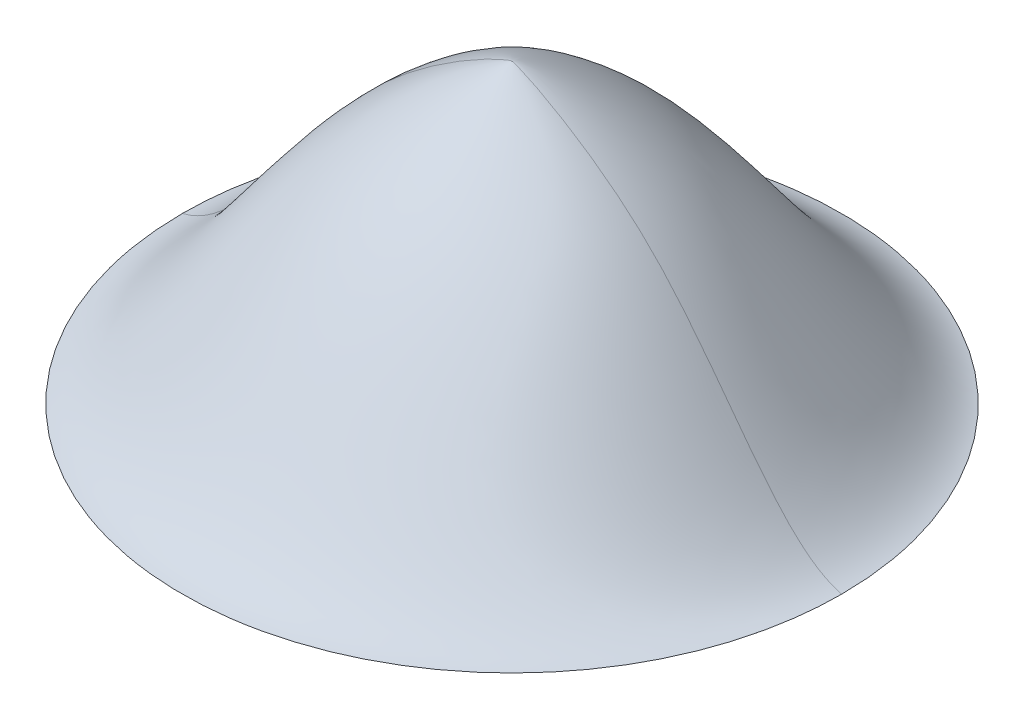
ISO-10303-21;
HEADER;
FILE_DESCRIPTION(('STEP AP214'),'2;1');
FILE_NAME('part.step','',(''),(''),'','','');
FILE_SCHEMA(('AUTOMOTIVE_DESIGN { 1 0 10303 214 1 1 1 1 }'));
ENDSEC;
DATA;
#1=APPLICATION_CONTEXT('core data for automotive mechanical design processes');
#2=APPLICATION_PROTOCOL_DEFINITION('international standard','automotive_design',2000,#1);
#3=PRODUCT_CONTEXT('',#1,'mechanical');
#4=PRODUCT('Part','Part','',(#3));
#5=PRODUCT_RELATED_PRODUCT_CATEGORY('part','',(#4));
#6=PRODUCT_DEFINITION_FORMATION('','',#4);
#7=PRODUCT_DEFINITION_CONTEXT('part definition',#1,'design');
#8=PRODUCT_DEFINITION('design','',#6,#7);
#9=PRODUCT_DEFINITION_SHAPE('','',#8);
#10=(LENGTH_UNIT() NAMED_UNIT(*) SI_UNIT(.MILLI.,.METRE.));
#11=(NAMED_UNIT(*) PLANE_ANGLE_UNIT() SI_UNIT($,.RADIAN.));
#12=(NAMED_UNIT(*) SI_UNIT($,.STERADIAN.) SOLID_ANGLE_UNIT());
#13=UNCERTAINTY_MEASURE_WITH_UNIT(LENGTH_MEASURE(1.E-05),#10,'distance_accuracy_value','');
#14=(GEOMETRIC_REPRESENTATION_CONTEXT(3) GLOBAL_UNCERTAINTY_ASSIGNED_CONTEXT((#13)) GLOBAL_UNIT_ASSIGNED_CONTEXT((#10,
#11,#12)) REPRESENTATION_CONTEXT('',''));
#15=CARTESIAN_POINT('',(0.,0.,0.));
#16=DIRECTION('',(0.,0.,1.));
#17=DIRECTION('',(1.,0.,0.));
#18=AXIS2_PLACEMENT_3D('',#15,#16,#17);
#19=CARTESIAN_POINT('',(-0.5,0.,0.));
#20=CARTESIAN_POINT('',(-0.5,0.,1.));
#21=CARTESIAN_POINT('',(0.5,0.,1.));
#22=CARTESIAN_POINT('',(0.5,0.,0.));
#23=CARTESIAN_POINT('',(-0.402796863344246,0.023485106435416,0.));
#24=CARTESIAN_POINT('',(-0.402796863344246,0.023485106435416,0.805593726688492));
#25=CARTESIAN_POINT('',(0.402796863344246,0.0234851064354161,0.805593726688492));
#26=CARTESIAN_POINT('',(0.402796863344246,0.0234851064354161,0.));
#27=CARTESIAN_POINT('',(-0.265412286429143,0.327841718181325,0.));
#28=CARTESIAN_POINT('',(-0.265412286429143,0.327841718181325,0.530824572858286));
#29=CARTESIAN_POINT('',(0.265412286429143,0.327841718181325,0.530824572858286));
#30=CARTESIAN_POINT('',(0.265412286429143,0.327841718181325,0.));
#31=CARTESIAN_POINT('',(-0.0105448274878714,0.45,0.));
#32=CARTESIAN_POINT('',(-0.0105448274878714,0.45,0.0210896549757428));
#33=CARTESIAN_POINT('',(0.0105448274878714,0.45,0.0210896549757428));
#34=CARTESIAN_POINT('',(0.0105448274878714,0.45,0.));
#35=CARTESIAN_POINT('',(0.,0.45,0.));
#36=CARTESIAN_POINT('',(0.,0.45,0.));
#37=CARTESIAN_POINT('',(0.,0.45,0.));
#38=CARTESIAN_POINT('',(0.,0.45,0.));
#39=(BOUNDED_SURFACE() B_SPLINE_SURFACE(3,3,((#19,#20,#21,#22),(#23,#24,#25,#26),(#27,#28,#29,
#30),(#31,#32,#33,#34),(#35,#36,#37,#38)),.UNSPECIFIED.,.F.,.F.,
.F.) B_SPLINE_SURFACE_WITH_KNOTS((4,1,4),(4,4),(0.,0.589485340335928,1.),(0.,1.),
.UNSPECIFIED.) GEOMETRIC_REPRESENTATION_ITEM() RATIONAL_B_SPLINE_SURFACE(((1.,0.333333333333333,
0.333333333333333,1.),(1.,0.333333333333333,0.333333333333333,1.),(1.,0.333333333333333,
0.333333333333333,1.),(1.,0.333333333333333,0.333333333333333,1.),(1.,0.333333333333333,
0.333333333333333,1.))) REPRESENTATION_ITEM('') SURFACE());
#40=CARTESIAN_POINT('',(-0.5,0.,0.));
#41=CARTESIAN_POINT('',(-0.500022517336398,0.,0.0276789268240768));
#42=CARTESIAN_POINT('',(-0.497702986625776,0.,0.0553514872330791));
#43=CARTESIAN_POINT('',(-0.488541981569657,0.,0.109938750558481));
#44=CARTESIAN_POINT('',(-0.48170050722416,0.,0.136853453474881));
#45=CARTESIAN_POINT('',(-0.463657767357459,0.,0.189179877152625));
#46=CARTESIAN_POINT('',(-0.452456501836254,0.,0.214591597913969));
#47=CARTESIAN_POINT('',(-0.425817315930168,0.,0.263566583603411));
#48=CARTESIAN_POINT('',(-0.410320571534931,0.,0.287097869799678));
#49=CARTESIAN_POINT('',(-0.375599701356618,0.,0.331229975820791));
#50=CARTESIAN_POINT('',(-0.356375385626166,0.,0.351830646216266));
#51=CARTESIAN_POINT('',(-0.315017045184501,0.,0.389271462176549));
#52=CARTESIAN_POINT('',(-0.292924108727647,0.,0.406157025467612));
#53=CARTESIAN_POINT('',(-0.246247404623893,0.,0.436038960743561));
#54=CARTESIAN_POINT('',(-0.221663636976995,0.,0.44903533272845));
#55=CARTESIAN_POINT('',(-0.170313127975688,0.,0.470939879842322));
#56=CARTESIAN_POINT('',(-0.143519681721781,0.,0.479785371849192));
#57=CARTESIAN_POINT('',(-0.0888215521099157,0.,0.492848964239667));
#58=CARTESIAN_POINT('',(-0.0609171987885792,0.,0.497068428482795));
#59=CARTESIAN_POINT('',(-0.0190542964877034,0.,0.499829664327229));
#60=CARTESIAN_POINT('',(-0.00519296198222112,0.,0.500164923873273));
#61=CARTESIAN_POINT('',(0.022509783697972,0.,0.499685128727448));
#62=CARTESIAN_POINT('',(0.0363511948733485,0.,0.498870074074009));
#63=CARTESIAN_POINT('',(0.0780933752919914,0.,0.494660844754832));
#64=CARTESIAN_POINT('',(0.105834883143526,0.,0.48947762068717));
#65=CARTESIAN_POINT('',(0.160047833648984,0.,0.474527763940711));
#66=CARTESIAN_POINT('',(0.186518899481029,0.,0.46475978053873));
#67=CARTESIAN_POINT('',(0.23708009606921,0.,0.441090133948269));
#68=CARTESIAN_POINT('',(0.261199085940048,0.,0.427250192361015));
#69=CARTESIAN_POINT('',(0.3068130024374,0.,0.395770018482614));
#70=CARTESIAN_POINT('',(0.328307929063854,0.,0.378129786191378));
#71=CARTESIAN_POINT('',(0.368371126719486,0.,0.339253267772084));
#72=CARTESIAN_POINT('',(0.386892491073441,0.,0.317968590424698));
#73=CARTESIAN_POINT('',(0.420098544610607,0.,0.272595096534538));
#74=CARTESIAN_POINT('',(0.434783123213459,0.,0.248506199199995));
#75=CARTESIAN_POINT('',(0.459722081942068,0.,0.198551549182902));
#76=CARTESIAN_POINT('',(0.470036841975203,0.,0.172716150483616));
#77=CARTESIAN_POINT('',(0.482178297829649,0.,0.133024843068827));
#78=CARTESIAN_POINT('',(0.485667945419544,0.,0.119656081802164));
#79=CARTESIAN_POINT('',(0.496157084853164,0.,0.0713767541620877));
#80=CARTESIAN_POINT('',(0.500002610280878,0.,0.0357707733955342));
#81=CARTESIAN_POINT('',(0.5,0.,0.));
#82=B_SPLINE_CURVE_WITH_KNOTS('',3,(#40,#41,#42,#43,#44,#45,#46,#47,#48,#49,#50,#51,#52,#53,#54,
#55,#56,#57,#58,#59,#60,#61,#62,#63,#64,#65,#66,#67,#68,#69,#70,#71,#72,#73,#74,#75,#76,#77,#78,
#79,#80,#81),.UNSPECIFIED.,.F.,.F.,(4,2,2,2,2,2,2,2,2,2,2,2,2,2,2,2,2,2,2,2,4),(0.,
0.0829307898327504,0.165861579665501,0.248792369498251,0.332920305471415,0.417052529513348,
0.50009071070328,0.583128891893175,0.667383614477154,0.751613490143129,0.793168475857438,
0.834723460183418,0.918953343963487,1.00320805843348,1.08624623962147,1.16928442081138,
1.25352550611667,1.33776901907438,1.42080720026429,1.46221842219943,1.56899302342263),.UNSPECIFIED.);
#83=CARTESIAN_POINT('',(-0.5,0.,0.));
#84=VERTEX_POINT('',#83);
#85=CARTESIAN_POINT('',(0.5,0.,0.));
#86=VERTEX_POINT('',#85);
#87=EDGE_CURVE('E23',#84,#86,#82,.T.);
#88=CARTESIAN_POINT('',(0.5,0.,0.));
#89=CARTESIAN_POINT('',(0.402796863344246,0.0234851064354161,0.));
#90=CARTESIAN_POINT('',(0.265412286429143,0.327841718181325,0.));
#91=CARTESIAN_POINT('',(0.0105448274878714,0.45,0.));
#92=CARTESIAN_POINT('',(0.,0.45,0.));
#93=B_SPLINE_CURVE_WITH_KNOTS('',3,(#88,#89,#90,#91,#92),.UNSPECIFIED.,.F.,.F.,(4,1,4),(0.,
0.589485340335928,1.),.UNSPECIFIED.);
#94=CARTESIAN_POINT('',(0.,0.45,0.));
#95=VERTEX_POINT('',#94);
#96=EDGE_CURVE('E37',#86,#95,#93,.T.);
#97=CARTESIAN_POINT('',(-0.5,0.,0.));
#98=CARTESIAN_POINT('',(-0.402796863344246,0.023485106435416,0.));
#99=CARTESIAN_POINT('',(-0.265412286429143,0.327841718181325,0.));
#100=CARTESIAN_POINT('',(-0.0105448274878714,0.45,0.));
#101=CARTESIAN_POINT('',(0.,0.45,0.));
#102=B_SPLINE_CURVE_WITH_KNOTS('',3,(#97,#98,#99,#100,#101),.UNSPECIFIED.,.F.,.F.,(4,1,4),(0.,
0.589485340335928,1.),.UNSPECIFIED.);
#103=EDGE_CURVE('E45',#95,#84,#102,.F.);
#104=ORIENTED_EDGE('',*,*,#87,.T.);
#105=ORIENTED_EDGE('',*,*,#96,.T.);
#106=ORIENTED_EDGE('',*,*,#103,.T.);
#107=EDGE_LOOP('',(#104,#105,#106));
#108=FACE_BOUND('',#107,.T.);
#109=ADVANCED_FACE('F17',(#108),#39,.F.);
#110=CARTESIAN_POINT('',(0.5,0.,0.));
#111=CARTESIAN_POINT('',(0.5,0.,-1.));
#112=CARTESIAN_POINT('',(-0.5,0.,-1.));
#113=CARTESIAN_POINT('',(-0.5,0.,0.));
#114=CARTESIAN_POINT('',(0.402796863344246,0.0234851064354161,0.));
#115=CARTESIAN_POINT('',(0.402796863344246,0.0234851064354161,-0.805593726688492));
#116=CARTESIAN_POINT('',(-0.402796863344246,0.023485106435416,-0.805593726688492));
#117=CARTESIAN_POINT('',(-0.402796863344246,0.023485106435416,0.));
#118=CARTESIAN_POINT('',(0.265412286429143,0.327841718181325,0.));
#119=CARTESIAN_POINT('',(0.265412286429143,0.327841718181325,-0.530824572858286));
#120=CARTESIAN_POINT('',(-0.265412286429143,0.327841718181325,-0.530824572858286));
#121=CARTESIAN_POINT('',(-0.265412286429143,0.327841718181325,0.));
#122=CARTESIAN_POINT('',(0.0105448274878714,0.45,0.));
#123=CARTESIAN_POINT('',(0.0105448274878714,0.45,-0.0210896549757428));
#124=CARTESIAN_POINT('',(-0.0105448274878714,0.45,-0.0210896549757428));
#125=CARTESIAN_POINT('',(-0.0105448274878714,0.45,0.));
#126=CARTESIAN_POINT('',(0.,0.45,0.));
#127=CARTESIAN_POINT('',(0.,0.45,0.));
#128=CARTESIAN_POINT('',(0.,0.45,0.));
#129=CARTESIAN_POINT('',(0.,0.45,0.));
#130=(BOUNDED_SURFACE() B_SPLINE_SURFACE(3,3,((#110,#111,#112,#113),(#114,#115,#116,#117),(#118,
#119,#120,#121),(#122,#123,#124,#125),(#126,#127,#128,#129)),.UNSPECIFIED.,.F.,.F.,
.F.) B_SPLINE_SURFACE_WITH_KNOTS((4,1,4),(4,4),(0.,0.589485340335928,1.),(0.,1.),
.UNSPECIFIED.) GEOMETRIC_REPRESENTATION_ITEM() RATIONAL_B_SPLINE_SURFACE(((1.,0.333333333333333,
0.333333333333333,1.),(1.,0.333333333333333,0.333333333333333,1.),(1.,0.333333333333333,
0.333333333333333,1.),(1.,0.333333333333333,0.333333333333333,1.),(1.,0.333333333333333,
0.333333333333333,1.))) REPRESENTATION_ITEM('') SURFACE());
#131=CARTESIAN_POINT('',(0.5,0.,0.));
#132=CARTESIAN_POINT('',(0.500022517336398,0.,-0.0276789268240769));
#133=CARTESIAN_POINT('',(0.497702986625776,0.,-0.0553514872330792));
#134=CARTESIAN_POINT('',(0.488541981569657,0.,-0.109938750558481));
#135=CARTESIAN_POINT('',(0.48170050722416,0.,-0.136853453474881));
#136=CARTESIAN_POINT('',(0.463657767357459,0.,-0.189179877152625));
#137=CARTESIAN_POINT('',(0.452456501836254,0.,-0.214591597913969));
#138=CARTESIAN_POINT('',(0.425817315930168,0.,-0.263566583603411));
#139=CARTESIAN_POINT('',(0.410320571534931,0.,-0.287097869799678));
#140=CARTESIAN_POINT('',(0.375599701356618,0.,-0.331229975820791));
#141=CARTESIAN_POINT('',(0.356375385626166,0.,-0.351830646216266));
#142=CARTESIAN_POINT('',(0.315017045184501,0.,-0.389271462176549));
#143=CARTESIAN_POINT('',(0.292924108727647,0.,-0.406157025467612));
#144=CARTESIAN_POINT('',(0.246247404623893,0.,-0.436038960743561));
#145=CARTESIAN_POINT('',(0.221663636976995,0.,-0.44903533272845));
#146=CARTESIAN_POINT('',(0.170313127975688,0.,-0.470939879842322));
#147=CARTESIAN_POINT('',(0.14351968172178,0.,-0.479785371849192));
#148=CARTESIAN_POINT('',(0.0888215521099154,0.,-0.492848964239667));
#149=CARTESIAN_POINT('',(0.060917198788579,0.,-0.497068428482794));
#150=CARTESIAN_POINT('',(0.0190542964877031,0.,-0.499829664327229));
#151=CARTESIAN_POINT('',(0.00519296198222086,0.,-0.500164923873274));
#152=CARTESIAN_POINT('',(-0.0225097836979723,0.,-0.499685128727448));
#153=CARTESIAN_POINT('',(-0.0363511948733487,0.,-0.498870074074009));
#154=CARTESIAN_POINT('',(-0.0780933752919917,0.,-0.494660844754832));
#155=CARTESIAN_POINT('',(-0.105834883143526,0.,-0.48947762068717));
#156=CARTESIAN_POINT('',(-0.160047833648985,0.,-0.474527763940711));
#157=CARTESIAN_POINT('',(-0.18651889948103,0.,-0.46475978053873));
#158=CARTESIAN_POINT('',(-0.237080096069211,0.,-0.441090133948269));
#159=CARTESIAN_POINT('',(-0.261199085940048,0.,-0.427250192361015));
#160=CARTESIAN_POINT('',(-0.3068130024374,0.,-0.395770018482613));
#161=CARTESIAN_POINT('',(-0.328307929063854,0.,-0.378129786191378));
#162=CARTESIAN_POINT('',(-0.368371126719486,0.,-0.339253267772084));
#163=CARTESIAN_POINT('',(-0.386892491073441,0.,-0.317968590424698));
#164=CARTESIAN_POINT('',(-0.420098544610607,0.,-0.272595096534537));
#165=CARTESIAN_POINT('',(-0.43478312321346,0.,-0.248506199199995));
#166=CARTESIAN_POINT('',(-0.459722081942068,0.,-0.198551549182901));
#167=CARTESIAN_POINT('',(-0.470036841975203,0.,-0.172716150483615));
#168=CARTESIAN_POINT('',(-0.482178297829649,0.,-0.133024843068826));
#169=CARTESIAN_POINT('',(-0.485667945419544,0.,-0.119656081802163));
#170=CARTESIAN_POINT('',(-0.496157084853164,0.,-0.0713767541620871));
#171=CARTESIAN_POINT('',(-0.500002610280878,0.,-0.035770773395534));
#172=CARTESIAN_POINT('',(-0.5,0.,0.));
#173=B_SPLINE_CURVE_WITH_KNOTS('',3,(#131,#132,#133,#134,#135,#136,#137,#138,#139,#140,#141,
#142,#143,#144,#145,#146,#147,#148,#149,#150,#151,#152,#153,#154,#155,#156,#157,#158,#159,#160,
#161,#162,#163,#164,#165,#166,#167,#168,#169,#170,#171,#172),.UNSPECIFIED.,.F.,.F.,(4,2,2,2,2,2,
2,2,2,2,2,2,2,2,2,2,2,2,2,2,4),(0.,0.0829307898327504,0.165861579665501,0.248792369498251,
0.332920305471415,0.417052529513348,0.50009071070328,0.583128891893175,0.667383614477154,
0.751613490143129,0.793168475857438,0.834723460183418,0.918953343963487,1.00320805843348,
1.08624623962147,1.16928442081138,1.25352550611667,1.33776901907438,1.42080720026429,
1.46221842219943,1.56899302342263),.UNSPECIFIED.);
#174=EDGE_CURVE('E11',#86,#84,#173,.T.);
#175=ORIENTED_EDGE('',*,*,#103,.F.);
#176=ORIENTED_EDGE('',*,*,#96,.F.);
#177=ORIENTED_EDGE('',*,*,#174,.T.);
#178=EDGE_LOOP('',(#175,#176,#177));
#179=FACE_BOUND('',#178,.T.);
#180=ADVANCED_FACE('F46',(#179),#130,.F.);
#181=CARTESIAN_POINT('',(0.,0.,0.));
#182=DIRECTION('',(0.,1.,0.));
#183=DIRECTION('',(-1.,0.,0.));
#184=AXIS2_PLACEMENT_3D('',#181,#182,#183);
#185=PLANE('',#184);
#186=ORIENTED_EDGE('',*,*,#87,.F.);
#187=ORIENTED_EDGE('',*,*,#174,.F.);
#188=EDGE_LOOP('',(#186,#187));
#189=FACE_BOUND('',#188,.T.);
#190=ADVANCED_FACE('F67',(#189),#185,.F.);
#191=CLOSED_SHELL('',(#109,#180,#190));
#192=MANIFOLD_SOLID_BREP('B1',#191);
#193=ADVANCED_BREP_SHAPE_REPRESENTATION('',(#18,#192),#14);
#194=SHAPE_DEFINITION_REPRESENTATION(#9,#193);
ENDSEC;
END-ISO-10303-21;
